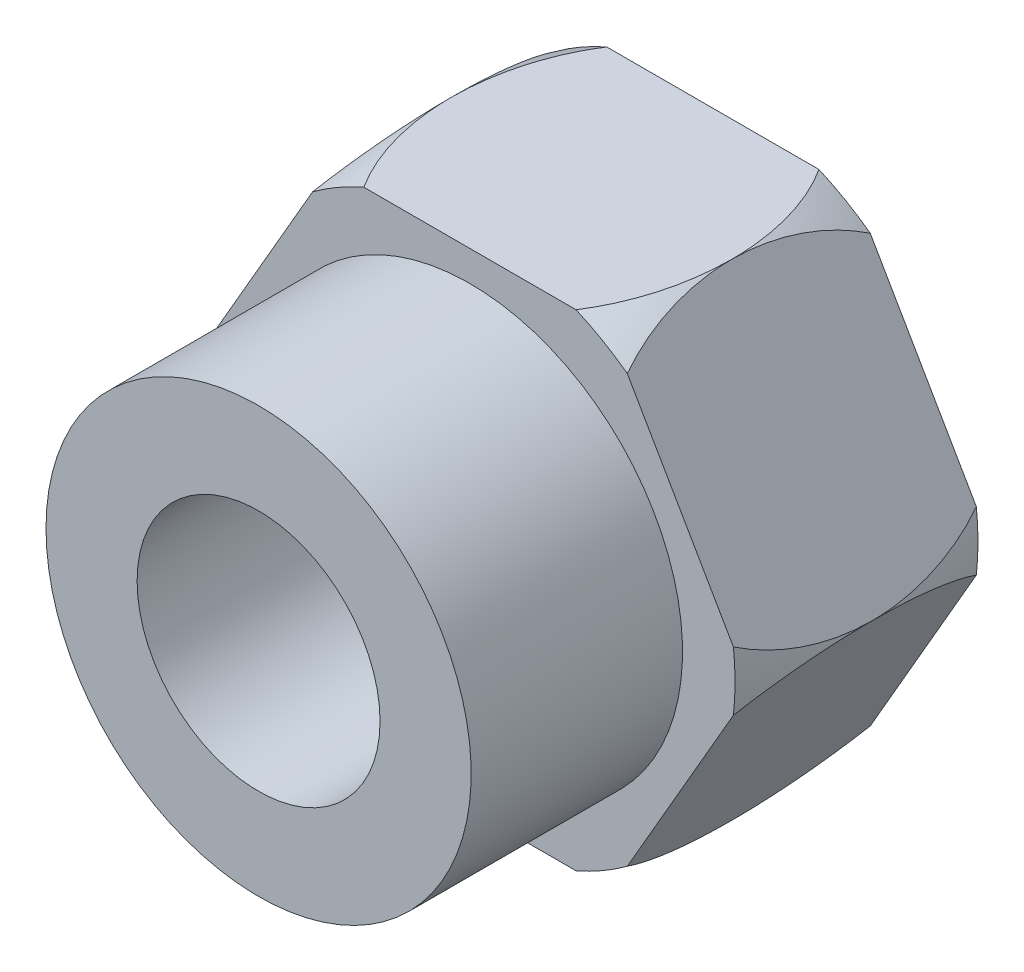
from build123d import *

# Parameters (mm, degrees)
EXTRUDE1_DEPTH     = 6.35
SKETCH5_R          = 3.175
CUT_EXTRUDE1_DEPTH = 16.980482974


with BuildPart() as part:
    # Sketch2 → Extrude1 (new body)
    with BuildSketch(Plane.XY):
        Polygon((7.332348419, 0), (3.666174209, 6.35), (-3.666174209, 6.35), (-7.332348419, 0), (-3.666174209, -6.35), (3.666174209, -6.35), align=None)
    extrude(amount=EXTRUDE1_DEPTH)

    # Sketch3 → Revolve1 (revolve)
    with BuildSketch(Plane(origin=(0, 0, 0), x_dir=(1, 0, 0), z_dir=(0, 1, 0)), mode=Mode.PRIVATE) as revolve1_sk:
        with BuildLine():
            Line((1.5875, 0.8255), (1.5875, -11.8745))
            Line((1.5875, -11.8745), (5.55625, -11.8745))
            Line((5.55625, -11.8745), (5.55625, 0))
            ThreePointArc((5.55625, 0), (5.314466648, 0.583716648), (4.73075, 0.8255))
            Line((4.73075, 0.8255), (1.5875, 0.8255))
        make_face()
    revolve(revolve1_sk.sketch.rotate(Axis((0, 0, 0), (0, 0, 1)), 180), axis=Axis((0, 0, 0), (0, 0, 1)))

    # Sketch4 → Cut-Revolve1 (revolve, cut)
    with BuildSketch(Plane(origin=(0, 0, 0), x_dir=(1, 0, 0), z_dir=(0, 1, 0))):
        with BuildLine():
            Line((8.89, 1.27), (8.89, -7.62))
            Line((8.89, -7.62), (6.929070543, -7.62))
            Line((6.929070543, -7.62), (6.929070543, -6.35))
            ThreePointArc((6.929070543, -6.35), (7.332348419, -3.175), (6.929070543, 0))
            Line((6.929070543, 0), (6.929070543, 1.27))
            Line((6.929070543, 1.27), (8.89, 1.27))
        make_face()
    revolve(axis=Axis((0, 0, 0), (0, 0, 1)), mode=Mode.SUBTRACT)

    # Sketch5 → Cut-Extrude1 (cut, through all)
    with BuildSketch(Plane(origin=(0, 0, -0.8255), x_dir=(-1, 0, 0), z_dir=(0, 0, -1))):
        Circle(SKETCH5_R)
    extrude(amount=-CUT_EXTRUDE1_DEPTH, mode=Mode.SUBTRACT)


solid = part.part
